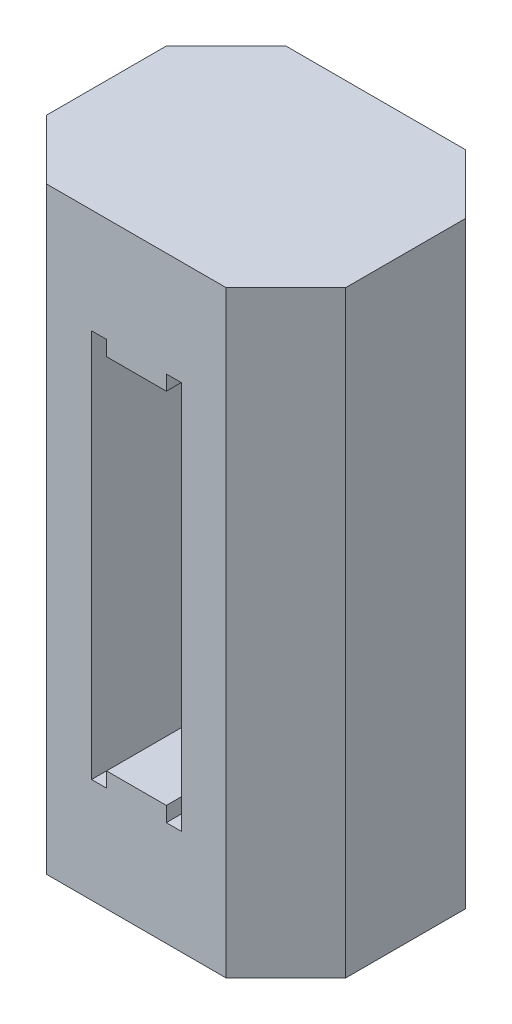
ISO-10303-21;
HEADER;
FILE_DESCRIPTION(('STEP AP214'),'2;1');
FILE_NAME('part.step','',(''),(''),'','','');
FILE_SCHEMA(('AUTOMOTIVE_DESIGN { 1 0 10303 214 1 1 1 1 }'));
ENDSEC;
DATA;
#1=APPLICATION_CONTEXT('core data for automotive mechanical design processes');
#2=APPLICATION_PROTOCOL_DEFINITION('international standard','automotive_design',2000,#1);
#3=PRODUCT_CONTEXT('',#1,'mechanical');
#4=PRODUCT('Part','Part','',(#3));
#5=PRODUCT_RELATED_PRODUCT_CATEGORY('part','',(#4));
#6=PRODUCT_DEFINITION_FORMATION('','',#4);
#7=PRODUCT_DEFINITION_CONTEXT('part definition',#1,'design');
#8=PRODUCT_DEFINITION('design','',#6,#7);
#9=PRODUCT_DEFINITION_SHAPE('','',#8);
#10=(LENGTH_UNIT() NAMED_UNIT(*) SI_UNIT(.MILLI.,.METRE.));
#11=(NAMED_UNIT(*) PLANE_ANGLE_UNIT() SI_UNIT($,.RADIAN.));
#12=(NAMED_UNIT(*) SI_UNIT($,.STERADIAN.) SOLID_ANGLE_UNIT());
#13=UNCERTAINTY_MEASURE_WITH_UNIT(LENGTH_MEASURE(1.E-05),#10,'distance_accuracy_value','');
#14=(GEOMETRIC_REPRESENTATION_CONTEXT(3) GLOBAL_UNCERTAINTY_ASSIGNED_CONTEXT((#13)) GLOBAL_UNIT_ASSIGNED_CONTEXT((#10,
#11,#12)) REPRESENTATION_CONTEXT('',''));
#15=CARTESIAN_POINT('',(0.,0.,0.));
#16=DIRECTION('',(0.,0.,1.));
#17=DIRECTION('',(1.,0.,0.));
#18=AXIS2_PLACEMENT_3D('',#15,#16,#17);
#19=CARTESIAN_POINT('',(0.,0.,8.));
#20=DIRECTION('',(1.,0.,0.));
#21=DIRECTION('',(0.,0.,-1.));
#22=AXIS2_PLACEMENT_3D('',#19,#20,#21);
#23=PLANE('',#22);
#24=DIRECTION('',(0.,0.,-1.));
#25=VECTOR('',#24,1.);
#26=CARTESIAN_POINT('',(0.,0.,8.));
#27=LINE('',#26,#25);
#28=CARTESIAN_POINT('',(0.,0.,5.99999999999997));
#29=VERTEX_POINT('',#28);
#30=CARTESIAN_POINT('',(0.,0.,2.00000000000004));
#31=VERTEX_POINT('',#30);
#32=EDGE_CURVE('E297',#29,#31,#27,.T.);
#33=ORIENTED_EDGE('',*,*,#32,.F.);
#34=DIRECTION('',(0.,1.,0.));
#35=VECTOR('',#34,1.);
#36=CARTESIAN_POINT('',(0.,0.,5.99999999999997));
#37=LINE('',#36,#35);
#38=CARTESIAN_POINT('',(0.,20.,5.99999999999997));
#39=VERTEX_POINT('',#38);
#40=EDGE_CURVE('E326',#29,#39,#37,.T.);
#41=ORIENTED_EDGE('',*,*,#40,.T.);
#42=DIRECTION('',(0.,0.,-1.));
#43=VECTOR('',#42,1.);
#44=CARTESIAN_POINT('',(0.,20.,8.));
#45=LINE('',#44,#43);
#46=CARTESIAN_POINT('',(0.,20.,2.00000000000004));
#47=VERTEX_POINT('',#46);
#48=EDGE_CURVE('E288',#39,#47,#45,.T.);
#49=ORIENTED_EDGE('',*,*,#48,.T.);
#50=DIRECTION('',(0.,-1.,0.));
#51=VECTOR('',#50,1.);
#52=CARTESIAN_POINT('',(0.,0.,2.00000000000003));
#53=LINE('',#52,#51);
#54=EDGE_CURVE('E324',#47,#31,#53,.T.);
#55=ORIENTED_EDGE('',*,*,#54,.T.);
#56=EDGE_LOOP('',(#33,#41,#49,#55));
#57=FACE_BOUND('',#56,.T.);
#58=ADVANCED_FACE('F31',(#57),#23,.F.);
#59=CARTESIAN_POINT('',(0.,0.,8.));
#60=DIRECTION('',(0.,1.,0.));
#61=DIRECTION('',(0.,0.,1.));
#62=AXIS2_PLACEMENT_3D('',#59,#60,#61);
#63=PLANE('',#62);
#64=DIRECTION('',(0.,0.,-1.));
#65=VECTOR('',#64,1.);
#66=CARTESIAN_POINT('',(10.,0.,8.));
#67=LINE('',#66,#65);
#68=CARTESIAN_POINT('',(10.,0.,5.99999999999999));
#69=VERTEX_POINT('',#68);
#70=CARTESIAN_POINT('',(10.,0.,2.00000000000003));
#71=VERTEX_POINT('',#70);
#72=EDGE_CURVE('E294',#69,#71,#67,.T.);
#73=ORIENTED_EDGE('',*,*,#72,.F.);
#74=DIRECTION('',(0.707106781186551,0.,-0.707106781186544));
#75=VECTOR('',#74,1.);
#76=CARTESIAN_POINT('',(7.99999999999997,0.,8.));
#77=LINE('',#76,#75);
#78=CARTESIAN_POINT('',(7.99999999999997,0.,8.));
#79=VERTEX_POINT('',#78);
#80=EDGE_CURVE('E322',#69,#79,#77,.F.);
#81=ORIENTED_EDGE('',*,*,#80,.T.);
#82=DIRECTION('',(1.,0.,0.));
#83=VECTOR('',#82,1.);
#84=CARTESIAN_POINT('',(0.,0.,8.));
#85=LINE('',#84,#83);
#86=CARTESIAN_POINT('',(2.00000000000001,0.,8.));
#87=VERTEX_POINT('',#86);
#88=EDGE_CURVE('E282',#87,#79,#85,.T.);
#89=ORIENTED_EDGE('',*,*,#88,.F.);
#90=DIRECTION('',(0.707106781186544,0.,0.707106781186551));
#91=VECTOR('',#90,1.);
#92=CARTESIAN_POINT('',(2.00000000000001,0.,8.));
#93=LINE('',#92,#91);
#94=EDGE_CURVE('E53',#87,#29,#93,.F.);
#95=ORIENTED_EDGE('',*,*,#94,.T.);
#96=ORIENTED_EDGE('',*,*,#32,.T.);
#97=DIRECTION('',(0.707106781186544,0.,-0.707106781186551));
#98=VECTOR('',#97,1.);
#99=CARTESIAN_POINT('',(0.,0.,2.00000000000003));
#100=LINE('',#99,#98);
#101=CARTESIAN_POINT('',(2.00000000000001,0.,0.));
#102=VERTEX_POINT('',#101);
#103=EDGE_CURVE('E45',#31,#102,#100,.T.);
#104=ORIENTED_EDGE('',*,*,#103,.T.);
#105=DIRECTION('',(1.,0.,0.));
#106=VECTOR('',#105,1.);
#107=CARTESIAN_POINT('',(0.,0.,0.));
#108=LINE('',#107,#106);
#109=CARTESIAN_POINT('',(7.99999999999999,0.,0.));
#110=VERTEX_POINT('',#109);
#111=EDGE_CURVE('E258',#102,#110,#108,.T.);
#112=ORIENTED_EDGE('',*,*,#111,.T.);
#113=DIRECTION('',(0.707106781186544,0.,0.707106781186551));
#114=VECTOR('',#113,1.);
#115=CARTESIAN_POINT('',(10.,0.,2.00000000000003));
#116=LINE('',#115,#114);
#117=EDGE_CURVE('E319',#110,#71,#116,.T.);
#118=ORIENTED_EDGE('',*,*,#117,.T.);
#119=EDGE_LOOP('',(#73,#81,#89,#95,#96,#104,#112,#118));
#120=FACE_BOUND('',#119,.T.);
#121=ADVANCED_FACE('F341',(#120),#63,.F.);
#122=CARTESIAN_POINT('',(10.,0.,8.));
#123=DIRECTION('',(-1.,0.,0.));
#124=DIRECTION('',(0.,0.,1.));
#125=AXIS2_PLACEMENT_3D('',#122,#123,#124);
#126=PLANE('',#125);
#127=DIRECTION('',(0.,0.,-1.));
#128=VECTOR('',#127,1.);
#129=CARTESIAN_POINT('',(10.,20.,8.));
#130=LINE('',#129,#128);
#131=CARTESIAN_POINT('',(10.,20.,5.99999999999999));
#132=VERTEX_POINT('',#131);
#133=CARTESIAN_POINT('',(10.,20.,2.00000000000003));
#134=VERTEX_POINT('',#133);
#135=EDGE_CURVE('E291',#132,#134,#130,.T.);
#136=ORIENTED_EDGE('',*,*,#135,.F.);
#137=DIRECTION('',(0.,-1.,0.));
#138=VECTOR('',#137,1.);
#139=CARTESIAN_POINT('',(10.,0.,5.99999999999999));
#140=LINE('',#139,#138);
#141=EDGE_CURVE('E316',#132,#69,#140,.T.);
#142=ORIENTED_EDGE('',*,*,#141,.T.);
#143=ORIENTED_EDGE('',*,*,#72,.T.);
#144=DIRECTION('',(0.,1.,0.));
#145=VECTOR('',#144,1.);
#146=CARTESIAN_POINT('',(10.,20.,2.00000000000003));
#147=LINE('',#146,#145);
#148=EDGE_CURVE('E313',#71,#134,#147,.T.);
#149=ORIENTED_EDGE('',*,*,#148,.T.);
#150=EDGE_LOOP('',(#136,#142,#143,#149));
#151=FACE_BOUND('',#150,.T.);
#152=ADVANCED_FACE('F348',(#151),#126,.F.);
#153=CARTESIAN_POINT('',(0.,20.,8.));
#154=DIRECTION('',(0.,-1.,0.));
#155=DIRECTION('',(0.,0.,-1.));
#156=AXIS2_PLACEMENT_3D('',#153,#154,#155);
#157=PLANE('',#156);
#158=DIRECTION('',(-1.,0.,0.));
#159=VECTOR('',#158,1.);
#160=CARTESIAN_POINT('',(0.,20.,8.));
#161=LINE('',#160,#159);
#162=CARTESIAN_POINT('',(7.99999999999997,20.,8.));
#163=VERTEX_POINT('',#162);
#164=CARTESIAN_POINT('',(2.00000000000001,20.,8.));
#165=VERTEX_POINT('',#164);
#166=EDGE_CURVE('E285',#163,#165,#161,.T.);
#167=ORIENTED_EDGE('',*,*,#166,.F.);
#168=DIRECTION('',(-0.707106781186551,0.,0.707106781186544));
#169=VECTOR('',#168,1.);
#170=CARTESIAN_POINT('',(7.99999999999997,20.,8.));
#171=LINE('',#170,#169);
#172=EDGE_CURVE('E311',#163,#132,#171,.F.);
#173=ORIENTED_EDGE('',*,*,#172,.T.);
#174=ORIENTED_EDGE('',*,*,#135,.T.);
#175=DIRECTION('',(-0.707106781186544,0.,-0.707106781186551));
#176=VECTOR('',#175,1.);
#177=CARTESIAN_POINT('',(10.,20.,2.00000000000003));
#178=LINE('',#177,#176);
#179=CARTESIAN_POINT('',(7.99999999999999,20.,0.));
#180=VERTEX_POINT('',#179);
#181=EDGE_CURVE('E307',#134,#180,#178,.T.);
#182=ORIENTED_EDGE('',*,*,#181,.T.);
#183=DIRECTION('',(-1.,0.,0.));
#184=VECTOR('',#183,1.);
#185=CARTESIAN_POINT('',(0.,20.,0.));
#186=LINE('',#185,#184);
#187=CARTESIAN_POINT('',(2.00000000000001,20.,0.));
#188=VERTEX_POINT('',#187);
#189=EDGE_CURVE('E279',#180,#188,#186,.T.);
#190=ORIENTED_EDGE('',*,*,#189,.T.);
#191=DIRECTION('',(-0.707106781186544,0.,0.707106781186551));
#192=VECTOR('',#191,1.);
#193=CARTESIAN_POINT('',(0.,20.,2.00000000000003));
#194=LINE('',#193,#192);
#195=EDGE_CURVE('E305',#188,#47,#194,.T.);
#196=ORIENTED_EDGE('',*,*,#195,.T.);
#197=ORIENTED_EDGE('',*,*,#48,.F.);
#198=DIRECTION('',(-0.707106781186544,0.,-0.707106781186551));
#199=VECTOR('',#198,1.);
#200=CARTESIAN_POINT('',(2.00000000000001,20.,8.));
#201=LINE('',#200,#199);
#202=EDGE_CURVE('E309',#39,#165,#201,.F.);
#203=ORIENTED_EDGE('',*,*,#202,.T.);
#204=EDGE_LOOP('',(#167,#173,#174,#182,#190,#196,#197,#203));
#205=FACE_BOUND('',#204,.T.);
#206=ADVANCED_FACE('F335',(#205),#157,.F.);
#207=CARTESIAN_POINT('',(0.,20.,8.));
#208=DIRECTION('',(0.,0.,-1.));
#209=DIRECTION('',(-1.,0.,0.));
#210=AXIS2_PLACEMENT_3D('',#207,#208,#209);
#211=PLANE('',#210);
#212=DIRECTION('',(1.,0.,0.));
#213=VECTOR('',#212,1.);
#214=CARTESIAN_POINT('',(3.5,3.5,8.));
#215=LINE('',#214,#213);
#216=CARTESIAN_POINT('',(3.5,3.5,8.));
#217=VERTEX_POINT('',#216);
#218=CARTESIAN_POINT('',(4.,3.49999999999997,8.));
#219=VERTEX_POINT('',#218);
#220=EDGE_CURVE('E184',#217,#219,#215,.T.);
#221=ORIENTED_EDGE('',*,*,#220,.F.);
#222=DIRECTION('',(0.,-1.,0.));
#223=VECTOR('',#222,1.);
#224=CARTESIAN_POINT('',(3.5,16.5,8.));
#225=LINE('',#224,#223);
#226=CARTESIAN_POINT('',(3.5,16.5,8.));
#227=VERTEX_POINT('',#226);
#228=EDGE_CURVE('E188',#227,#217,#225,.T.);
#229=ORIENTED_EDGE('',*,*,#228,.F.);
#230=DIRECTION('',(-1.,0.,0.));
#231=VECTOR('',#230,1.);
#232=CARTESIAN_POINT('',(3.5,16.5,8.));
#233=LINE('',#232,#231);
#234=CARTESIAN_POINT('',(4.,16.5,8.));
#235=VERTEX_POINT('',#234);
#236=EDGE_CURVE('E220',#235,#227,#233,.T.);
#237=ORIENTED_EDGE('',*,*,#236,.F.);
#238=DIRECTION('',(0.,1.,0.));
#239=VECTOR('',#238,1.);
#240=CARTESIAN_POINT('',(4.,16.,8.));
#241=LINE('',#240,#239);
#242=CARTESIAN_POINT('',(4.,16.,8.));
#243=VERTEX_POINT('',#242);
#244=EDGE_CURVE('E217',#243,#235,#241,.T.);
#245=ORIENTED_EDGE('',*,*,#244,.F.);
#246=DIRECTION('',(-1.,0.,0.));
#247=VECTOR('',#246,1.);
#248=CARTESIAN_POINT('',(4.,16.,8.));
#249=LINE('',#248,#247);
#250=CARTESIAN_POINT('',(6.,16.,8.));
#251=VERTEX_POINT('',#250);
#252=EDGE_CURVE('E214',#251,#243,#249,.T.);
#253=ORIENTED_EDGE('',*,*,#252,.F.);
#254=DIRECTION('',(0.,-1.,0.));
#255=VECTOR('',#254,1.);
#256=CARTESIAN_POINT('',(6.,16.,8.));
#257=LINE('',#256,#255);
#258=CARTESIAN_POINT('',(6.,16.5,8.));
#259=VERTEX_POINT('',#258);
#260=EDGE_CURVE('E211',#259,#251,#257,.T.);
#261=ORIENTED_EDGE('',*,*,#260,.F.);
#262=DIRECTION('',(-1.,0.,0.));
#263=VECTOR('',#262,1.);
#264=CARTESIAN_POINT('',(6.,16.5,8.));
#265=LINE('',#264,#263);
#266=CARTESIAN_POINT('',(6.5,16.5,8.));
#267=VERTEX_POINT('',#266);
#268=EDGE_CURVE('E208',#267,#259,#265,.T.);
#269=ORIENTED_EDGE('',*,*,#268,.F.);
#270=DIRECTION('',(0.,1.,0.));
#271=VECTOR('',#270,1.);
#272=CARTESIAN_POINT('',(6.5,16.5,8.));
#273=LINE('',#272,#271);
#274=CARTESIAN_POINT('',(6.5,3.5,8.));
#275=VERTEX_POINT('',#274);
#276=EDGE_CURVE('E205',#275,#267,#273,.T.);
#277=ORIENTED_EDGE('',*,*,#276,.F.);
#278=DIRECTION('',(1.,0.,0.));
#279=VECTOR('',#278,1.);
#280=CARTESIAN_POINT('',(5.99999999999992,3.49999999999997,8.));
#281=LINE('',#280,#279);
#282=CARTESIAN_POINT('',(5.99999999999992,3.49999999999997,8.));
#283=VERTEX_POINT('',#282);
#284=EDGE_CURVE('E202',#283,#275,#281,.T.);
#285=ORIENTED_EDGE('',*,*,#284,.F.);
#286=DIRECTION('',(0.,-1.,0.));
#287=VECTOR('',#286,1.);
#288=CARTESIAN_POINT('',(5.99999999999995,4.,8.));
#289=LINE('',#288,#287);
#290=CARTESIAN_POINT('',(5.99999999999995,4.,8.));
#291=VERTEX_POINT('',#290);
#292=EDGE_CURVE('E196',#291,#283,#289,.T.);
#293=ORIENTED_EDGE('',*,*,#292,.F.);
#294=DIRECTION('',(1.,0.,0.));
#295=VECTOR('',#294,1.);
#296=CARTESIAN_POINT('',(4.,4.,8.));
#297=LINE('',#296,#295);
#298=CARTESIAN_POINT('',(4.,4.,8.));
#299=VERTEX_POINT('',#298);
#300=EDGE_CURVE('E194',#299,#291,#297,.T.);
#301=ORIENTED_EDGE('',*,*,#300,.F.);
#302=DIRECTION('',(0.,1.,0.));
#303=VECTOR('',#302,1.);
#304=CARTESIAN_POINT('',(4.,4.,8.));
#305=LINE('',#304,#303);
#306=EDGE_CURVE('E172',#219,#299,#305,.T.);
#307=ORIENTED_EDGE('',*,*,#306,.F.);
#308=EDGE_LOOP('',(#221,#229,#237,#245,#253,#261,#269,#277,#285,#293,#301,#307));
#309=FACE_BOUND('',#308,.T.);
#310=ORIENTED_EDGE('',*,*,#88,.T.);
#311=DIRECTION('',(0.,1.,0.));
#312=VECTOR('',#311,1.);
#313=CARTESIAN_POINT('',(7.99999999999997,20.,8.));
#314=LINE('',#313,#312);
#315=EDGE_CURVE('E302',#79,#163,#314,.T.);
#316=ORIENTED_EDGE('',*,*,#315,.T.);
#317=ORIENTED_EDGE('',*,*,#166,.T.);
#318=DIRECTION('',(0.,-1.,0.));
#319=VECTOR('',#318,1.);
#320=CARTESIAN_POINT('',(2.00000000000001,20.,8.));
#321=LINE('',#320,#319);
#322=EDGE_CURVE('E299',#165,#87,#321,.T.);
#323=ORIENTED_EDGE('',*,*,#322,.T.);
#324=EDGE_LOOP('',(#310,#316,#317,#323));
#325=FACE_BOUND('',#324,.T.);
#326=ADVANCED_FACE('F190',(#309,#325),#211,.F.);
#327=CARTESIAN_POINT('',(0.,20.,0.));
#328=DIRECTION('',(0.,0.,-1.));
#329=DIRECTION('',(-1.,0.,0.));
#330=AXIS2_PLACEMENT_3D('',#327,#328,#329);
#331=PLANE('',#330);
#332=DIRECTION('',(0.,-1.,0.));
#333=VECTOR('',#332,1.);
#334=CARTESIAN_POINT('',(3.5,16.5,0.));
#335=LINE('',#334,#333);
#336=CARTESIAN_POINT('',(3.5,16.5,0.));
#337=VERTEX_POINT('',#336);
#338=CARTESIAN_POINT('',(3.5,3.5,0.));
#339=VERTEX_POINT('',#338);
#340=EDGE_CURVE('E223',#337,#339,#335,.T.);
#341=ORIENTED_EDGE('',*,*,#340,.T.);
#342=DIRECTION('',(1.,0.,0.));
#343=VECTOR('',#342,1.);
#344=CARTESIAN_POINT('',(3.5,3.5,0.));
#345=LINE('',#344,#343);
#346=CARTESIAN_POINT('',(4.,3.49999999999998,0.));
#347=VERTEX_POINT('',#346);
#348=EDGE_CURVE('E226',#339,#347,#345,.T.);
#349=ORIENTED_EDGE('',*,*,#348,.T.);
#350=DIRECTION('',(0.,1.,0.));
#351=VECTOR('',#350,1.);
#352=CARTESIAN_POINT('',(4.,4.,0.));
#353=LINE('',#352,#351);
#354=CARTESIAN_POINT('',(4.,4.,0.));
#355=VERTEX_POINT('',#354);
#356=EDGE_CURVE('E175',#347,#355,#353,.T.);
#357=ORIENTED_EDGE('',*,*,#356,.T.);
#358=DIRECTION('',(1.,0.,0.));
#359=VECTOR('',#358,1.);
#360=CARTESIAN_POINT('',(4.,4.,0.));
#361=LINE('',#360,#359);
#362=CARTESIAN_POINT('',(5.99999999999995,4.,0.));
#363=VERTEX_POINT('',#362);
#364=EDGE_CURVE('E229',#355,#363,#361,.T.);
#365=ORIENTED_EDGE('',*,*,#364,.T.);
#366=DIRECTION('',(0.,-1.,0.));
#367=VECTOR('',#366,1.);
#368=CARTESIAN_POINT('',(5.99999999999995,4.,0.));
#369=LINE('',#368,#367);
#370=CARTESIAN_POINT('',(5.99999999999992,3.49999999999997,0.));
#371=VERTEX_POINT('',#370);
#372=EDGE_CURVE('E232',#363,#371,#369,.T.);
#373=ORIENTED_EDGE('',*,*,#372,.T.);
#374=DIRECTION('',(1.,0.,0.));
#375=VECTOR('',#374,1.);
#376=CARTESIAN_POINT('',(5.99999999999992,3.49999999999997,0.));
#377=LINE('',#376,#375);
#378=CARTESIAN_POINT('',(6.5,3.5,0.));
#379=VERTEX_POINT('',#378);
#380=EDGE_CURVE('E235',#371,#379,#377,.T.);
#381=ORIENTED_EDGE('',*,*,#380,.T.);
#382=DIRECTION('',(0.,1.,0.));
#383=VECTOR('',#382,1.);
#384=CARTESIAN_POINT('',(6.5,16.5,0.));
#385=LINE('',#384,#383);
#386=CARTESIAN_POINT('',(6.5,16.5,0.));
#387=VERTEX_POINT('',#386);
#388=EDGE_CURVE('E238',#379,#387,#385,.T.);
#389=ORIENTED_EDGE('',*,*,#388,.T.);
#390=DIRECTION('',(-1.,0.,0.));
#391=VECTOR('',#390,1.);
#392=CARTESIAN_POINT('',(6.,16.5,0.));
#393=LINE('',#392,#391);
#394=CARTESIAN_POINT('',(6.,16.5,0.));
#395=VERTEX_POINT('',#394);
#396=EDGE_CURVE('E241',#387,#395,#393,.T.);
#397=ORIENTED_EDGE('',*,*,#396,.T.);
#398=DIRECTION('',(0.,-1.,0.));
#399=VECTOR('',#398,1.);
#400=CARTESIAN_POINT('',(6.,16.,0.));
#401=LINE('',#400,#399);
#402=CARTESIAN_POINT('',(6.,16.,0.));
#403=VERTEX_POINT('',#402);
#404=EDGE_CURVE('E244',#395,#403,#401,.T.);
#405=ORIENTED_EDGE('',*,*,#404,.T.);
#406=DIRECTION('',(-1.,0.,0.));
#407=VECTOR('',#406,1.);
#408=CARTESIAN_POINT('',(4.,16.,0.));
#409=LINE('',#408,#407);
#410=CARTESIAN_POINT('',(4.,16.,0.));
#411=VERTEX_POINT('',#410);
#412=EDGE_CURVE('E247',#403,#411,#409,.T.);
#413=ORIENTED_EDGE('',*,*,#412,.T.);
#414=DIRECTION('',(0.,1.,0.));
#415=VECTOR('',#414,1.);
#416=CARTESIAN_POINT('',(4.,16.,0.));
#417=LINE('',#416,#415);
#418=CARTESIAN_POINT('',(4.,16.5,0.));
#419=VERTEX_POINT('',#418);
#420=EDGE_CURVE('E250',#411,#419,#417,.T.);
#421=ORIENTED_EDGE('',*,*,#420,.T.);
#422=DIRECTION('',(-1.,0.,0.));
#423=VECTOR('',#422,1.);
#424=CARTESIAN_POINT('',(3.5,16.5,0.));
#425=LINE('',#424,#423);
#426=EDGE_CURVE('E253',#419,#337,#425,.T.);
#427=ORIENTED_EDGE('',*,*,#426,.T.);
#428=EDGE_LOOP('',(#341,#349,#357,#365,#373,#381,#389,#397,#405,#413,#421,#427));
#429=FACE_BOUND('',#428,.T.);
#430=ORIENTED_EDGE('',*,*,#189,.F.);
#431=DIRECTION('',(0.,-1.,0.));
#432=VECTOR('',#431,1.);
#433=CARTESIAN_POINT('',(7.99999999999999,0.,0.));
#434=LINE('',#433,#432);
#435=EDGE_CURVE('E11',#180,#110,#434,.T.);
#436=ORIENTED_EDGE('',*,*,#435,.T.);
#437=ORIENTED_EDGE('',*,*,#111,.F.);
#438=DIRECTION('',(0.,1.,0.));
#439=VECTOR('',#438,1.);
#440=CARTESIAN_POINT('',(2.00000000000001,20.,0.));
#441=LINE('',#440,#439);
#442=EDGE_CURVE('E38',#102,#188,#441,.T.);
#443=ORIENTED_EDGE('',*,*,#442,.T.);
#444=EDGE_LOOP('',(#430,#436,#437,#443));
#445=FACE_BOUND('',#444,.T.);
#446=ADVANCED_FACE('F330',(#429,#445),#331,.T.);
#447=CARTESIAN_POINT('',(3.5,16.5,0.));
#448=DIRECTION('',(-1.,0.,0.));
#449=DIRECTION('',(0.,-1.,0.));
#450=AXIS2_PLACEMENT_3D('',#447,#448,#449);
#451=PLANE('',#450);
#452=ORIENTED_EDGE('',*,*,#228,.T.);
#453=DIRECTION('',(0.,0.,1.));
#454=VECTOR('',#453,1.);
#455=CARTESIAN_POINT('',(3.5,3.5,0.));
#456=LINE('',#455,#454);
#457=EDGE_CURVE('E180',#339,#217,#456,.T.);
#458=ORIENTED_EDGE('',*,*,#457,.F.);
#459=ORIENTED_EDGE('',*,*,#340,.F.);
#460=DIRECTION('',(0.,0.,1.));
#461=VECTOR('',#460,1.);
#462=CARTESIAN_POINT('',(3.5,16.5,0.));
#463=LINE('',#462,#461);
#464=EDGE_CURVE('E256',#337,#227,#463,.T.);
#465=ORIENTED_EDGE('',*,*,#464,.T.);
#466=EDGE_LOOP('',(#452,#458,#459,#465));
#467=FACE_BOUND('',#466,.T.);
#468=ADVANCED_FACE('F381',(#467),#451,.F.);
#469=CARTESIAN_POINT('',(3.5,16.5,0.));
#470=DIRECTION('',(0.,1.,0.));
#471=DIRECTION('',(-1.,0.,0.));
#472=AXIS2_PLACEMENT_3D('',#469,#470,#471);
#473=PLANE('',#472);
#474=ORIENTED_EDGE('',*,*,#236,.T.);
#475=ORIENTED_EDGE('',*,*,#464,.F.);
#476=ORIENTED_EDGE('',*,*,#426,.F.);
#477=DIRECTION('',(0.,0.,1.));
#478=VECTOR('',#477,1.);
#479=CARTESIAN_POINT('',(4.,16.5,0.));
#480=LINE('',#479,#478);
#481=EDGE_CURVE('E259',#419,#235,#480,.T.);
#482=ORIENTED_EDGE('',*,*,#481,.T.);
#483=EDGE_LOOP('',(#474,#475,#476,#482));
#484=FACE_BOUND('',#483,.T.);
#485=ADVANCED_FACE('F385',(#484),#473,.F.);
#486=CARTESIAN_POINT('',(4.,16.,0.));
#487=DIRECTION('',(1.,0.,0.));
#488=DIRECTION('',(0.,1.,0.));
#489=AXIS2_PLACEMENT_3D('',#486,#487,#488);
#490=PLANE('',#489);
#491=ORIENTED_EDGE('',*,*,#244,.T.);
#492=ORIENTED_EDGE('',*,*,#481,.F.);
#493=ORIENTED_EDGE('',*,*,#420,.F.);
#494=DIRECTION('',(0.,0.,1.));
#495=VECTOR('',#494,1.);
#496=CARTESIAN_POINT('',(4.,16.,0.));
#497=LINE('',#496,#495);
#498=EDGE_CURVE('E261',#411,#243,#497,.T.);
#499=ORIENTED_EDGE('',*,*,#498,.T.);
#500=EDGE_LOOP('',(#491,#492,#493,#499));
#501=FACE_BOUND('',#500,.T.);
#502=ADVANCED_FACE('F418',(#501),#490,.F.);
#503=CARTESIAN_POINT('',(4.,16.,0.));
#504=DIRECTION('',(0.,1.,0.));
#505=DIRECTION('',(0.,0.,1.));
#506=AXIS2_PLACEMENT_3D('',#503,#504,#505);
#507=PLANE('',#506);
#508=ORIENTED_EDGE('',*,*,#252,.T.);
#509=ORIENTED_EDGE('',*,*,#498,.F.);
#510=ORIENTED_EDGE('',*,*,#412,.F.);
#511=DIRECTION('',(0.,0.,1.));
#512=VECTOR('',#511,1.);
#513=CARTESIAN_POINT('',(6.,16.,0.));
#514=LINE('',#513,#512);
#515=EDGE_CURVE('E263',#403,#251,#514,.T.);
#516=ORIENTED_EDGE('',*,*,#515,.T.);
#517=EDGE_LOOP('',(#508,#509,#510,#516));
#518=FACE_BOUND('',#517,.T.);
#519=ADVANCED_FACE('F414',(#518),#507,.F.);
#520=CARTESIAN_POINT('',(6.,16.,0.));
#521=DIRECTION('',(-1.,0.,0.));
#522=DIRECTION('',(0.,-1.,0.));
#523=AXIS2_PLACEMENT_3D('',#520,#521,#522);
#524=PLANE('',#523);
#525=ORIENTED_EDGE('',*,*,#260,.T.);
#526=ORIENTED_EDGE('',*,*,#515,.F.);
#527=ORIENTED_EDGE('',*,*,#404,.F.);
#528=DIRECTION('',(0.,0.,1.));
#529=VECTOR('',#528,1.);
#530=CARTESIAN_POINT('',(6.,16.5,0.));
#531=LINE('',#530,#529);
#532=EDGE_CURVE('E265',#395,#259,#531,.T.);
#533=ORIENTED_EDGE('',*,*,#532,.T.);
#534=EDGE_LOOP('',(#525,#526,#527,#533));
#535=FACE_BOUND('',#534,.T.);
#536=ADVANCED_FACE('F410',(#535),#524,.F.);
#537=CARTESIAN_POINT('',(6.,16.5,0.));
#538=DIRECTION('',(0.,1.,0.));
#539=DIRECTION('',(-1.,0.,0.));
#540=AXIS2_PLACEMENT_3D('',#537,#538,#539);
#541=PLANE('',#540);
#542=ORIENTED_EDGE('',*,*,#268,.T.);
#543=ORIENTED_EDGE('',*,*,#532,.F.);
#544=ORIENTED_EDGE('',*,*,#396,.F.);
#545=DIRECTION('',(0.,0.,1.));
#546=VECTOR('',#545,1.);
#547=CARTESIAN_POINT('',(6.5,16.5,0.));
#548=LINE('',#547,#546);
#549=EDGE_CURVE('E267',#387,#267,#548,.T.);
#550=ORIENTED_EDGE('',*,*,#549,.T.);
#551=EDGE_LOOP('',(#542,#543,#544,#550));
#552=FACE_BOUND('',#551,.T.);
#553=ADVANCED_FACE('F406',(#552),#541,.F.);
#554=CARTESIAN_POINT('',(6.5,16.5,0.));
#555=DIRECTION('',(1.,0.,0.));
#556=DIRECTION('',(0.,1.,0.));
#557=AXIS2_PLACEMENT_3D('',#554,#555,#556);
#558=PLANE('',#557);
#559=ORIENTED_EDGE('',*,*,#276,.T.);
#560=ORIENTED_EDGE('',*,*,#549,.F.);
#561=ORIENTED_EDGE('',*,*,#388,.F.);
#562=DIRECTION('',(0.,0.,1.));
#563=VECTOR('',#562,1.);
#564=CARTESIAN_POINT('',(6.5,3.5,0.));
#565=LINE('',#564,#563);
#566=EDGE_CURVE('E269',#379,#275,#565,.T.);
#567=ORIENTED_EDGE('',*,*,#566,.T.);
#568=EDGE_LOOP('',(#559,#560,#561,#567));
#569=FACE_BOUND('',#568,.T.);
#570=ADVANCED_FACE('F402',(#569),#558,.F.);
#571=CARTESIAN_POINT('',(5.99999999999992,3.49999999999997,0.));
#572=DIRECTION('',(0.,-1.,0.));
#573=DIRECTION('',(1.,0.,0.));
#574=AXIS2_PLACEMENT_3D('',#571,#572,#573);
#575=PLANE('',#574);
#576=ORIENTED_EDGE('',*,*,#284,.T.);
#577=ORIENTED_EDGE('',*,*,#566,.F.);
#578=ORIENTED_EDGE('',*,*,#380,.F.);
#579=DIRECTION('',(0.,0.,1.));
#580=VECTOR('',#579,1.);
#581=CARTESIAN_POINT('',(5.99999999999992,3.49999999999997,0.));
#582=LINE('',#581,#580);
#583=EDGE_CURVE('E271',#371,#283,#582,.T.);
#584=ORIENTED_EDGE('',*,*,#583,.T.);
#585=EDGE_LOOP('',(#576,#577,#578,#584));
#586=FACE_BOUND('',#585,.T.);
#587=ADVANCED_FACE('F398',(#586),#575,.F.);
#588=CARTESIAN_POINT('',(5.99999999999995,4.,0.));
#589=DIRECTION('',(-1.,0.,0.));
#590=DIRECTION('',(0.,-1.,0.));
#591=AXIS2_PLACEMENT_3D('',#588,#589,#590);
#592=PLANE('',#591);
#593=ORIENTED_EDGE('',*,*,#292,.T.);
#594=ORIENTED_EDGE('',*,*,#583,.F.);
#595=ORIENTED_EDGE('',*,*,#372,.F.);
#596=DIRECTION('',(0.,0.,1.));
#597=VECTOR('',#596,1.);
#598=CARTESIAN_POINT('',(5.99999999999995,4.,0.));
#599=LINE('',#598,#597);
#600=EDGE_CURVE('E273',#363,#291,#599,.T.);
#601=ORIENTED_EDGE('',*,*,#600,.T.);
#602=EDGE_LOOP('',(#593,#594,#595,#601));
#603=FACE_BOUND('',#602,.T.);
#604=ADVANCED_FACE('F394',(#603),#592,.F.);
#605=CARTESIAN_POINT('',(4.,4.,0.));
#606=DIRECTION('',(0.,-1.,0.));
#607=DIRECTION('',(1.,0.,0.));
#608=AXIS2_PLACEMENT_3D('',#605,#606,#607);
#609=PLANE('',#608);
#610=ORIENTED_EDGE('',*,*,#300,.T.);
#611=ORIENTED_EDGE('',*,*,#600,.F.);
#612=ORIENTED_EDGE('',*,*,#364,.F.);
#613=DIRECTION('',(0.,0.,1.));
#614=VECTOR('',#613,1.);
#615=CARTESIAN_POINT('',(4.,4.,0.));
#616=LINE('',#615,#614);
#617=EDGE_CURVE('E179',#355,#299,#616,.T.);
#618=ORIENTED_EDGE('',*,*,#617,.T.);
#619=EDGE_LOOP('',(#610,#611,#612,#618));
#620=FACE_BOUND('',#619,.T.);
#621=ADVANCED_FACE('F391',(#620),#609,.F.);
#622=CARTESIAN_POINT('',(4.,4.,0.));
#623=DIRECTION('',(1.,0.,0.));
#624=DIRECTION('',(0.,1.,0.));
#625=AXIS2_PLACEMENT_3D('',#622,#623,#624);
#626=PLANE('',#625);
#627=ORIENTED_EDGE('',*,*,#306,.T.);
#628=ORIENTED_EDGE('',*,*,#617,.F.);
#629=ORIENTED_EDGE('',*,*,#356,.F.);
#630=DIRECTION('',(0.,0.,1.));
#631=VECTOR('',#630,1.);
#632=CARTESIAN_POINT('',(4.,3.49999999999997,0.));
#633=LINE('',#632,#631);
#634=EDGE_CURVE('E168',#347,#219,#633,.T.);
#635=ORIENTED_EDGE('',*,*,#634,.T.);
#636=EDGE_LOOP('',(#627,#628,#629,#635));
#637=FACE_BOUND('',#636,.T.);
#638=ADVANCED_FACE('F170',(#637),#626,.F.);
#639=CARTESIAN_POINT('',(3.5,3.5,0.));
#640=DIRECTION('',(0.,-1.,0.));
#641=DIRECTION('',(1.,0.,0.));
#642=AXIS2_PLACEMENT_3D('',#639,#640,#641);
#643=PLANE('',#642);
#644=ORIENTED_EDGE('',*,*,#220,.T.);
#645=ORIENTED_EDGE('',*,*,#634,.F.);
#646=ORIENTED_EDGE('',*,*,#348,.F.);
#647=ORIENTED_EDGE('',*,*,#457,.T.);
#648=EDGE_LOOP('',(#644,#645,#646,#647));
#649=FACE_BOUND('',#648,.T.);
#650=ADVANCED_FACE('F185',(#649),#643,.F.);
#651=CARTESIAN_POINT('',(7.99999999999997,20.,8.));
#652=DIRECTION('',(-0.707106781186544,0.,-0.707106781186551));
#653=DIRECTION('',(-0.707106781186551,0.,0.707106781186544));
#654=AXIS2_PLACEMENT_3D('',#651,#652,#653);
#655=PLANE('',#654);
#656=ORIENTED_EDGE('',*,*,#80,.F.);
#657=ORIENTED_EDGE('',*,*,#141,.F.);
#658=ORIENTED_EDGE('',*,*,#172,.F.);
#659=ORIENTED_EDGE('',*,*,#315,.F.);
#660=EDGE_LOOP('',(#656,#657,#658,#659));
#661=FACE_BOUND('',#660,.T.);
#662=ADVANCED_FACE('F353',(#661),#655,.F.);
#663=CARTESIAN_POINT('',(2.00000000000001,20.,8.));
#664=DIRECTION('',(0.707106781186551,0.,-0.707106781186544));
#665=DIRECTION('',(-0.707106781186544,0.,-0.707106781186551));
#666=AXIS2_PLACEMENT_3D('',#663,#664,#665);
#667=PLANE('',#666);
#668=ORIENTED_EDGE('',*,*,#202,.F.);
#669=ORIENTED_EDGE('',*,*,#40,.F.);
#670=ORIENTED_EDGE('',*,*,#94,.F.);
#671=ORIENTED_EDGE('',*,*,#322,.F.);
#672=EDGE_LOOP('',(#668,#669,#670,#671));
#673=FACE_BOUND('',#672,.T.);
#674=ADVANCED_FACE('F357',(#673),#667,.F.);
#675=CARTESIAN_POINT('',(10.,0.,2.00000000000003));
#676=DIRECTION('',(0.707106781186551,0.,-0.707106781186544));
#677=DIRECTION('',(-0.707106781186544,0.,-0.707106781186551));
#678=AXIS2_PLACEMENT_3D('',#675,#676,#677);
#679=PLANE('',#678);
#680=ORIENTED_EDGE('',*,*,#117,.F.);
#681=ORIENTED_EDGE('',*,*,#435,.F.);
#682=ORIENTED_EDGE('',*,*,#181,.F.);
#683=ORIENTED_EDGE('',*,*,#148,.F.);
#684=EDGE_LOOP('',(#680,#681,#682,#683));
#685=FACE_BOUND('',#684,.T.);
#686=ADVANCED_FACE('F345',(#685),#679,.T.);
#687=CARTESIAN_POINT('',(0.,0.,2.00000000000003));
#688=DIRECTION('',(-0.707106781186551,0.,-0.707106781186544));
#689=DIRECTION('',(-0.707106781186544,0.,0.707106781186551));
#690=AXIS2_PLACEMENT_3D('',#687,#688,#689);
#691=PLANE('',#690);
#692=ORIENTED_EDGE('',*,*,#195,.F.);
#693=ORIENTED_EDGE('',*,*,#442,.F.);
#694=ORIENTED_EDGE('',*,*,#103,.F.);
#695=ORIENTED_EDGE('',*,*,#54,.F.);
#696=EDGE_LOOP('',(#692,#693,#694,#695));
#697=FACE_BOUND('',#696,.T.);
#698=ADVANCED_FACE('F337',(#697),#691,.T.);
#699=CLOSED_SHELL('',(#58,#121,#152,#206,#326,#446,#468,#485,#502,#519,#536,#553,#570,#587,#604,
#621,#638,#650,#662,#674,#686,#698));
#700=MANIFOLD_SOLID_BREP('B2',#699);
#701=ADVANCED_BREP_SHAPE_REPRESENTATION('',(#18,#700),#14);
#702=SHAPE_DEFINITION_REPRESENTATION(#9,#701);
ENDSEC;
END-ISO-10303-21;
